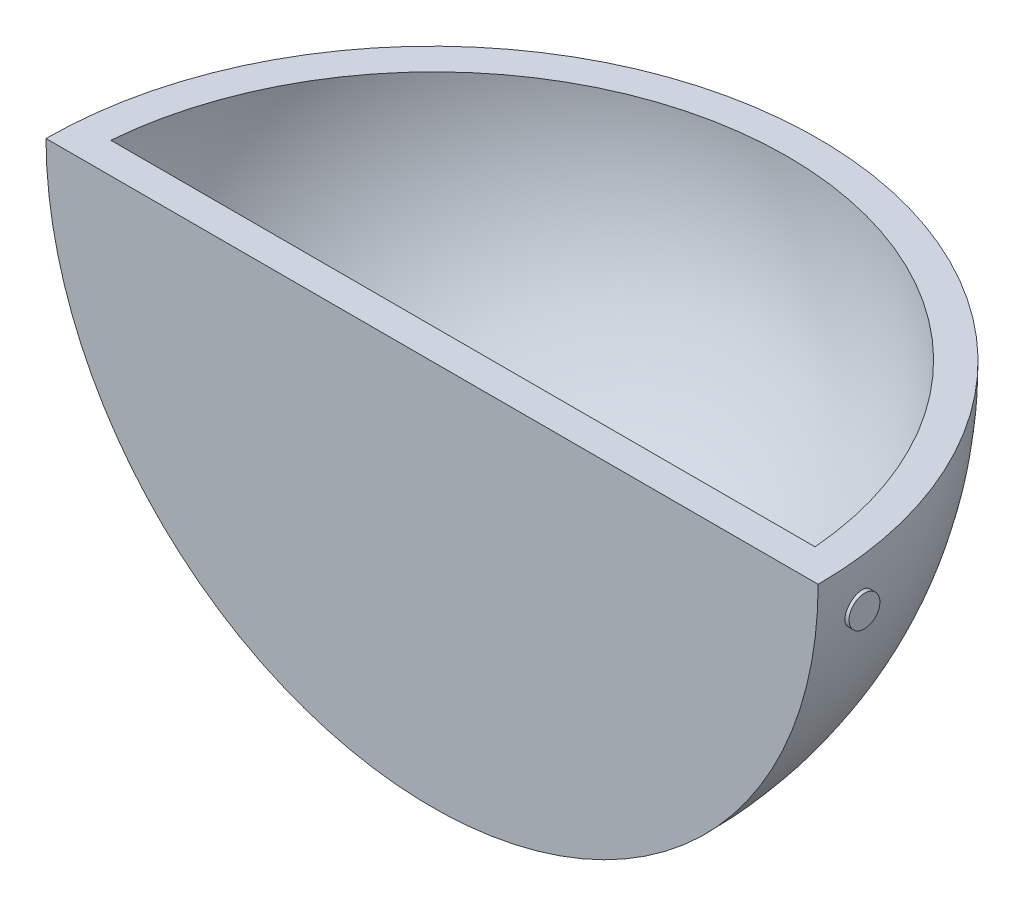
ISO-10303-21;
HEADER;
FILE_DESCRIPTION(('STEP AP214'),'2;1');
FILE_NAME('part.step','',(''),(''),'','','');
FILE_SCHEMA(('AUTOMOTIVE_DESIGN { 1 0 10303 214 1 1 1 1 }'));
ENDSEC;
DATA;
#1=APPLICATION_CONTEXT('core data for automotive mechanical design processes');
#2=APPLICATION_PROTOCOL_DEFINITION('international standard','automotive_design',2000,#1);
#3=PRODUCT_CONTEXT('',#1,'mechanical');
#4=PRODUCT('Part','Part','',(#3));
#5=PRODUCT_RELATED_PRODUCT_CATEGORY('part','',(#4));
#6=PRODUCT_DEFINITION_FORMATION('','',#4);
#7=PRODUCT_DEFINITION_CONTEXT('part definition',#1,'design');
#8=PRODUCT_DEFINITION('design','',#6,#7);
#9=PRODUCT_DEFINITION_SHAPE('','',#8);
#10=(LENGTH_UNIT() NAMED_UNIT(*) SI_UNIT(.MILLI.,.METRE.));
#11=(NAMED_UNIT(*) PLANE_ANGLE_UNIT() SI_UNIT($,.RADIAN.));
#12=(NAMED_UNIT(*) SI_UNIT($,.STERADIAN.) SOLID_ANGLE_UNIT());
#13=UNCERTAINTY_MEASURE_WITH_UNIT(LENGTH_MEASURE(1.E-05),#10,'distance_accuracy_value','');
#14=(GEOMETRIC_REPRESENTATION_CONTEXT(3) GLOBAL_UNCERTAINTY_ASSIGNED_CONTEXT((#13)) GLOBAL_UNIT_ASSIGNED_CONTEXT((#10,
#11,#12)) REPRESENTATION_CONTEXT('',''));
#15=CARTESIAN_POINT('',(0.,0.,0.));
#16=DIRECTION('',(0.,0.,1.));
#17=DIRECTION('',(1.,0.,0.));
#18=AXIS2_PLACEMENT_3D('',#15,#16,#17);
#19=CARTESIAN_POINT('',(125.,0.,0.));
#20=DIRECTION('',(-1.,0.,0.));
#21=DIRECTION('',(0.,0.,1.));
#22=AXIS2_PLACEMENT_3D('',#19,#20,#21);
#23=SPHERICAL_SURFACE('',#22,125.);
#24=CARTESIAN_POINT('',(247.220570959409,-18.5355339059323,-18.5355339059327));
#25=CARTESIAN_POINT('',(247.220570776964,-18.6337839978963,-18.4372852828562));
#26=CARTESIAN_POINT('',(247.221576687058,-18.7279238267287,-18.3349493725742));
#27=CARTESIAN_POINT('',(247.225592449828,-18.9073683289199,-18.1227834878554));
#28=CARTESIAN_POINT('',(247.228602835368,-18.9926706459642,-18.0129515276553));
#29=CARTESIAN_POINT('',(247.236608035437,-19.1538734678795,-17.7865156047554));
#30=CARTESIAN_POINT('',(247.241604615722,-19.2297655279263,-17.6699056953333));
#31=CARTESIAN_POINT('',(247.253544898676,-19.3715603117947,-17.4307995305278));
#32=CARTESIAN_POINT('',(247.260489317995,-19.437459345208,-17.3083011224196));
#33=CARTESIAN_POINT('',(247.276260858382,-19.558714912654,-17.0584881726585));
#34=CARTESIAN_POINT('',(247.285085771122,-19.6140836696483,-16.9311794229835));
#35=CARTESIAN_POINT('',(247.304558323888,-19.7140282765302,-16.6724753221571));
#36=CARTESIAN_POINT('',(247.315206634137,-19.7586001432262,-16.5410784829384));
#37=CARTESIAN_POINT('',(247.338235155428,-19.8366197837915,-16.2752585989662));
#38=CARTESIAN_POINT('',(247.350614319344,-19.8700742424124,-16.1408374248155));
#39=CARTESIAN_POINT('',(247.377020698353,-19.9257094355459,-15.8697898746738));
#40=CARTESIAN_POINT('',(247.391048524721,-19.9478859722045,-15.7331626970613));
#41=CARTESIAN_POINT('',(247.420736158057,-19.9809350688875,-15.4578509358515));
#42=CARTESIAN_POINT('',(247.436405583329,-19.9917363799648,-15.3191588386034));
#43=CARTESIAN_POINT('',(247.469192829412,-20.0017585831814,-15.0414772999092));
#44=CARTESIAN_POINT('',(247.486311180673,-20.000975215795,-14.9024877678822));
#45=CARTESIAN_POINT('',(247.521860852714,-19.9878676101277,-14.6252633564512));
#46=CARTESIAN_POINT('',(247.540291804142,-19.9755466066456,-14.4870282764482));
#47=CARTESIAN_POINT('',(247.578344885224,-19.9394881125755,-14.2121694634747));
#48=CARTESIAN_POINT('',(247.597967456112,-19.915746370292,-14.0755463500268));
#49=CARTESIAN_POINT('',(247.638531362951,-19.8566468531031,-13.8030545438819));
#50=CARTESIAN_POINT('',(247.659486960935,-19.8211361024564,-13.6672211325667));
#51=CARTESIAN_POINT('',(247.702328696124,-19.7388616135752,-13.3991047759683));
#52=CARTESIAN_POINT('',(247.724215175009,-19.6920937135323,-13.2668231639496));
#53=CARTESIAN_POINT('',(247.768751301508,-19.5876748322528,-13.0067984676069));
#54=CARTESIAN_POINT('',(247.791400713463,-19.5300271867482,-12.8790540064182));
#55=CARTESIAN_POINT('',(247.837310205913,-19.4042719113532,-12.6289197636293));
#56=CARTESIAN_POINT('',(247.860570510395,-19.3361603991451,-12.5065319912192));
#57=CARTESIAN_POINT('',(247.931623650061,-19.1149506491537,-12.145654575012));
#58=CARTESIAN_POINT('',(247.980147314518,-18.9462467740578,-11.916611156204));
#59=CARTESIAN_POINT('',(248.077642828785,-18.572677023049,-11.4905302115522));
#60=CARTESIAN_POINT('',(248.126614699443,-18.3678094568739,-11.2934941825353));
#61=CARTESIAN_POINT('',(248.223988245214,-17.9260923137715,-10.9356111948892));
#62=CARTESIAN_POINT('',(248.272384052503,-17.6890412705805,-10.7750107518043));
#63=CARTESIAN_POINT('',(248.36688920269,-17.1906921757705,-10.4964039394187));
#64=CARTESIAN_POINT('',(248.412998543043,-16.9293940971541,-10.3783976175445));
#65=CARTESIAN_POINT('',(248.50148185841,-16.3906922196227,-10.1888388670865));
#66=CARTESIAN_POINT('',(248.543865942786,-16.1133356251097,-10.1171571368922));
#67=CARTESIAN_POINT('',(248.623804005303,-15.5497792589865,-10.0221101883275));
#68=CARTESIAN_POINT('',(248.661358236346,-15.2635799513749,-9.998742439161));
#69=CARTESIAN_POINT('',(248.730134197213,-14.6938209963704,-10.0013478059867));
#70=CARTESIAN_POINT('',(248.761420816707,-14.4102667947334,-10.0267829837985));
#71=CARTESIAN_POINT('',(248.817229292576,-13.8509356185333,-10.1255481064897));
#72=CARTESIAN_POINT('',(248.84175169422,-13.5751580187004,-10.1988741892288));
#73=CARTESIAN_POINT('',(248.882981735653,-13.0433896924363,-10.3901855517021));
#74=CARTESIAN_POINT('',(248.899795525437,-12.7871733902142,-10.5075210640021));
#75=CARTESIAN_POINT('',(248.92560246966,-12.2977750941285,-10.783732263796));
#76=CARTESIAN_POINT('',(248.934596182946,-12.0645914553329,-10.9426049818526));
#77=CARTESIAN_POINT('',(248.944430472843,-11.6305622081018,-11.2953770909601));
#78=CARTESIAN_POINT('',(248.945360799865,-11.4293851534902,-11.4888663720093));
#79=CARTESIAN_POINT('',(248.939275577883,-11.0620285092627,-11.9065040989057));
#80=CARTESIAN_POINT('',(248.932260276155,-10.8958478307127,-12.1306515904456));
#81=CARTESIAN_POINT('',(248.910532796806,-10.6036215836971,-12.6023776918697));
#82=CARTESIAN_POINT('',(248.895845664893,-10.4774475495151,-12.8498779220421));
#83=CARTESIAN_POINT('',(248.85922780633,-10.2678742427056,-13.3618597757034));
#84=CARTESIAN_POINT('',(248.837296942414,-10.1844757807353,-13.6263417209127));
#85=CARTESIAN_POINT('',(248.786683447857,-10.0621584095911,-14.1664296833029));
#86=CARTESIAN_POINT('',(248.757961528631,-10.0235063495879,-14.4420923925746));
#87=CARTESIAN_POINT('',(248.694667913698,-9.99233026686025,-14.995340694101));
#88=CARTESIAN_POINT('',(248.660095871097,-9.99980898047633,-15.2729263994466));
#89=CARTESIAN_POINT('',(248.585612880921,-10.0607392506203,-15.8258504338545));
#90=CARTESIAN_POINT('',(248.545640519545,-10.1147651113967,-16.1011171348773));
#91=CARTESIAN_POINT('',(248.461821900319,-10.2677581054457,-16.6382514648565));
#92=CARTESIAN_POINT('',(248.417975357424,-10.3667285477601,-16.9001181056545));
#93=CARTESIAN_POINT('',(248.327000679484,-10.6082864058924,-17.4068136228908));
#94=CARTESIAN_POINT('',(248.279835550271,-10.7514580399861,-17.6513568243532));
#95=CARTESIAN_POINT('',(248.18405890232,-11.076929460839,-18.1127345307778));
#96=CARTESIAN_POINT('',(248.135447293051,-11.2592317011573,-18.3295672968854));
#97=CARTESIAN_POINT('',(248.062298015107,-11.5588129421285,-18.6302342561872));
#98=CARTESIAN_POINT('',(248.037750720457,-11.6636294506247,-18.7267871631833));
#99=CARTESIAN_POINT('',(247.988814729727,-11.8811260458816,-18.9106088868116));
#100=CARTESIAN_POINT('',(247.964425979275,-11.9938032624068,-18.9978810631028));
#101=CARTESIAN_POINT('',(247.915970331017,-12.2262811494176,-19.1625463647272));
#102=CARTESIAN_POINT('',(247.891903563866,-12.3460846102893,-19.2399355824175));
#103=CARTESIAN_POINT('',(247.844280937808,-12.5918939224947,-19.384212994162));
#104=CARTESIAN_POINT('',(247.820724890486,-12.7178974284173,-19.4511051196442));
#105=CARTESIAN_POINT('',(247.774262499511,-12.9753854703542,-19.5739814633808));
#106=CARTESIAN_POINT('',(247.751356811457,-13.1068752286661,-19.6299549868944));
#107=CARTESIAN_POINT('',(247.706395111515,-13.3742393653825,-19.7304641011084));
#108=CARTESIAN_POINT('',(247.684338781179,-13.5101120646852,-19.77500401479));
#109=CARTESIAN_POINT('',(247.641223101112,-13.7853654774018,-19.8523298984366));
#110=CARTESIAN_POINT('',(247.620164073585,-13.9247473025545,-19.8851120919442));
#111=CARTESIAN_POINT('',(247.579216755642,-14.2059204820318,-19.9386141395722));
#112=CARTESIAN_POINT('',(247.559328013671,-14.3477108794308,-19.9593386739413));
#113=CARTESIAN_POINT('',(247.521024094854,-14.6315388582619,-19.9884284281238));
#114=CARTESIAN_POINT('',(247.502598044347,-14.7735645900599,-19.9968949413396));
#115=CARTESIAN_POINT('',(247.467184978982,-15.0579450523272,-20.0016855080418));
#116=CARTESIAN_POINT('',(247.450197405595,-15.200299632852,-19.9980142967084));
#117=CARTESIAN_POINT('',(247.417775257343,-15.4844372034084,-19.9785149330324));
#118=CARTESIAN_POINT('',(247.402341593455,-15.6262198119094,-19.9626796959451));
#119=CARTESIAN_POINT('',(247.373165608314,-15.9080281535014,-19.9189235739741));
#120=CARTESIAN_POINT('',(247.359422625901,-16.0480545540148,-19.8910074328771));
#121=CARTESIAN_POINT('',(247.333900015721,-16.3235340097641,-19.823701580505));
#122=CARTESIAN_POINT('',(247.322096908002,-16.4590230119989,-19.7844678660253));
#123=CARTESIAN_POINT('',(247.300334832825,-16.7262825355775,-19.6946580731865));
#124=CARTESIAN_POINT('',(247.290375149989,-16.858054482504,-19.6440864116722));
#125=CARTESIAN_POINT('',(247.272382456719,-17.1168363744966,-19.5319826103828));
#126=CARTESIAN_POINT('',(247.264347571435,-17.2438508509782,-19.4704612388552));
#127=CARTESIAN_POINT('',(247.250258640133,-17.4922687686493,-19.3368749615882));
#128=CARTESIAN_POINT('',(247.244204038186,-17.6136737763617,-19.2648130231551));
#129=CARTESIAN_POINT('',(247.232991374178,-17.8765177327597,-19.0933442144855));
#130=CARTESIAN_POINT('',(247.228338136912,-18.0163507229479,-18.9914281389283));
#131=CARTESIAN_POINT('',(247.222128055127,-18.2847535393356,-18.7736272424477));
#132=CARTESIAN_POINT('',(247.220571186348,-18.4133234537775,-18.6577425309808));
#133=CARTESIAN_POINT('',(247.220570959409,-18.5355339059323,-18.5355339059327));
#134=B_SPLINE_CURVE_WITH_KNOTS('',3,(#24,#25,#26,#27,#28,#29,#30,#31,#32,#33,#34,#35,#36,#37,
#38,#39,#40,#41,#42,#43,#44,#45,#46,#47,#48,#49,#50,#51,#52,#53,#54,#55,#56,#57,#58,#59,#60,#61,
#62,#63,#64,#65,#66,#67,#68,#69,#70,#71,#72,#73,#74,#75,#76,#77,#78,#79,#80,#81,#82,#83,#84,#85,
#86,#87,#88,#89,#90,#91,#92,#93,#94,#95,#96,#97,#98,#99,#100,#101,#102,#103,#104,#105,#106,#107,
#108,#109,#110,#111,#112,#113,#114,#115,#116,#117,#118,#119,#120,#121,#122,#123,#124,#125,#126,
#127,#128,#129,#130,#131,#132,#133),.UNSPECIFIED.,.T.,.F.,(4,2,2,2,2,2,2,2,2,2,2,2,2,2,2,2,2,2,
2,2,2,2,2,2,2,2,2,2,2,2,2,2,2,2,2,2,2,2,2,2,2,2,2,2,2,2,2,2,2,2,2,2,2,2,4),(0.,
0.416684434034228,0.833479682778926,1.25064629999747,1.66796660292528,2.08479950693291,
2.50178595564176,2.91852122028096,3.33541148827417,3.75489770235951,4.17453815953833,
4.59406099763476,5.01374013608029,5.43910353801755,5.864624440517,6.29001508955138,
6.71556395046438,7.57688009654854,8.43823651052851,9.30525755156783,10.1722795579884,
11.0368709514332,11.9014170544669,12.7564882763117,13.6114905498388,14.4543367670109,
15.2971227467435,16.1305157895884,16.9638828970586,17.7945462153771,18.6252252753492,
19.4608330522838,20.2964903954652,21.1426082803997,21.9887884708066,22.846669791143,
23.7046049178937,24.1380079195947,24.5712534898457,25.0046698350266,25.4379234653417,
25.8715993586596,26.3051110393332,26.7387618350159,27.1722441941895,27.6021236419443,
28.03183540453,28.4617976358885,28.8915911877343,29.3157226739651,29.7396892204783,
30.1632411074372,30.5866739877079,31.10497978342,31.6232815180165),.UNSPECIFIED.);
#135=CARTESIAN_POINT('',(247.220570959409,-18.5355339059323,-18.5355339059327));
#136=VERTEX_POINT('',#135);
#137=EDGE_CURVE('E95',#136,#136,#134,.T.);
#138=ORIENTED_EDGE('',*,*,#137,.T.);
#139=EDGE_LOOP('',(#138));
#140=FACE_BOUND('',#139,.T.);
#141=CARTESIAN_POINT('',(125.,0.,0.));
#142=DIRECTION('',(0.,0.,1.));
#143=DIRECTION('',(1.,0.,0.));
#144=AXIS2_PLACEMENT_3D('',#141,#142,#143);
#145=CIRCLE('',#144,125.);
#146=CARTESIAN_POINT('',(0.,0.,0.));
#147=VERTEX_POINT('',#146);
#148=CARTESIAN_POINT('',(250.,0.,0.));
#149=VERTEX_POINT('',#148);
#150=EDGE_CURVE('E67',#147,#149,#145,.T.);
#151=ORIENTED_EDGE('',*,*,#150,.F.);
#152=CARTESIAN_POINT('',(125.,0.,0.));
#153=DIRECTION('',(0.,-1.,0.));
#154=DIRECTION('',(1.,0.,0.));
#155=AXIS2_PLACEMENT_3D('',#152,#153,#154);
#156=CIRCLE('',#155,125.);
#157=EDGE_CURVE('E53',#147,#149,#156,.T.);
#158=ORIENTED_EDGE('',*,*,#157,.T.);
#159=EDGE_LOOP('',(#151,#158));
#160=FACE_BOUND('',#159,.T.);
#161=CARTESIAN_POINT('',(2.77942904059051,-18.5355339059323,-18.5355339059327));
#162=CARTESIAN_POINT('',(2.77942922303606,-18.4372852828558,-18.6337839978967));
#163=CARTESIAN_POINT('',(2.77842331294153,-18.3349493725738,-18.7279238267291));
#164=CARTESIAN_POINT('',(2.7744075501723,-18.1227834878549,-18.9073683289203));
#165=CARTESIAN_POINT('',(2.77139716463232,-18.0129515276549,-18.9926706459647));
#166=CARTESIAN_POINT('',(2.76339196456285,-17.786515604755,-19.15387346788));
#167=CARTESIAN_POINT('',(2.75839538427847,-17.6699056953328,-19.2297655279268));
#168=CARTESIAN_POINT('',(2.74645510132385,-17.4307995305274,-19.3715603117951));
#169=CARTESIAN_POINT('',(2.73951068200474,-17.3083011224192,-19.4374593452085));
#170=CARTESIAN_POINT('',(2.72373914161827,-17.0584881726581,-19.5587149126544));
#171=CARTESIAN_POINT('',(2.71491422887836,-16.9311794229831,-19.6140836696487));
#172=CARTESIAN_POINT('',(2.69544167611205,-16.6724753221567,-19.7140282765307));
#173=CARTESIAN_POINT('',(2.68479336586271,-16.541078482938,-19.7586001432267));
#174=CARTESIAN_POINT('',(2.66176484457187,-16.2752585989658,-19.836619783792));
#175=CARTESIAN_POINT('',(2.6493856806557,-16.1408374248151,-19.8700742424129));
#176=CARTESIAN_POINT('',(2.62297930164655,-15.8697898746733,-19.9257094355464));
#177=CARTESIAN_POINT('',(2.60895147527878,-15.7331626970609,-19.947885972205));
#178=CARTESIAN_POINT('',(2.57926384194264,-15.457850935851,-19.9809350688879));
#179=CARTESIAN_POINT('',(2.56359441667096,-15.319158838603,-19.9917363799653));
#180=CARTESIAN_POINT('',(2.53080717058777,-15.0414772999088,-20.0017585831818));
#181=CARTESIAN_POINT('',(2.51368881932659,-14.9024877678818,-20.0009752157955));
#182=CARTESIAN_POINT('',(2.47813914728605,-14.6252633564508,-19.9878676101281));
#183=CARTESIAN_POINT('',(2.45970819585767,-14.4870282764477,-19.975546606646));
#184=CARTESIAN_POINT('',(2.42165511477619,-14.2121694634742,-19.939488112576));
#185=CARTESIAN_POINT('',(2.40203254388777,-14.0755463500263,-19.9157463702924));
#186=CARTESIAN_POINT('',(2.36146863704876,-13.8030545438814,-19.8566468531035));
#187=CARTESIAN_POINT('',(2.34051303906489,-13.6672211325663,-19.8211361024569));
#188=CARTESIAN_POINT('',(2.29767130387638,-13.3991047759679,-19.7388616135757));
#189=CARTESIAN_POINT('',(2.2757848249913,-13.2668231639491,-19.6920937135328));
#190=CARTESIAN_POINT('',(2.23124869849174,-13.0067984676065,-19.5876748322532));
#191=CARTESIAN_POINT('',(2.20859928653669,-12.8790540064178,-19.5300271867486));
#192=CARTESIAN_POINT('',(2.16268979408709,-12.6289197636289,-19.4042719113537));
#193=CARTESIAN_POINT('',(2.13942948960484,-12.5065319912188,-19.3361603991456));
#194=CARTESIAN_POINT('',(2.06837634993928,-12.1456545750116,-19.1149506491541));
#195=CARTESIAN_POINT('',(2.01985268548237,-11.9166111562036,-18.9462467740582));
#196=CARTESIAN_POINT('',(1.92235717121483,-11.4905302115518,-18.5726770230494));
#197=CARTESIAN_POINT('',(1.87338530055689,-11.2934941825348,-18.3678094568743));
#198=CARTESIAN_POINT('',(1.77601175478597,-10.9356111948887,-17.9260923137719));
#199=CARTESIAN_POINT('',(1.72761594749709,-10.7750107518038,-17.6890412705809));
#200=CARTESIAN_POINT('',(1.63311079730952,-10.4964039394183,-17.190692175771));
#201=CARTESIAN_POINT('',(1.58700145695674,-10.378397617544,-16.9293940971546));
#202=CARTESIAN_POINT('',(1.49851814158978,-10.1888388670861,-16.3906922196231));
#203=CARTESIAN_POINT('',(1.45613405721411,-10.1171571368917,-16.1133356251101));
#204=CARTESIAN_POINT('',(1.37619599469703,-10.0221101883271,-15.5497792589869));
#205=CARTESIAN_POINT('',(1.33864176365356,-9.99874243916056,-15.2635799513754));
#206=CARTESIAN_POINT('',(1.26986580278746,-10.0013478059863,-14.6938209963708));
#207=CARTESIAN_POINT('',(1.23857918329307,-10.026782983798,-14.4102667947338));
#208=CARTESIAN_POINT('',(1.18277070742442,-10.1255481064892,-13.8509356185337));
#209=CARTESIAN_POINT('',(1.15824830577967,-10.1988741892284,-13.5751580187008));
#210=CARTESIAN_POINT('',(1.11701826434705,-10.3901855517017,-13.0433896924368));
#211=CARTESIAN_POINT('',(1.10020447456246,-10.5075210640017,-12.7871733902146));
#212=CARTESIAN_POINT('',(1.07439753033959,-10.7837322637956,-12.2977750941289));
#213=CARTESIAN_POINT('',(1.06540381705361,-10.9426049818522,-12.0645914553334));
#214=CARTESIAN_POINT('',(1.05556952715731,-11.2953770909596,-11.6305622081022));
#215=CARTESIAN_POINT('',(1.05463920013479,-11.4888663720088,-11.4293851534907));
#216=CARTESIAN_POINT('',(1.06072442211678,-11.9065040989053,-11.0620285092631));
#217=CARTESIAN_POINT('',(1.06773972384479,-12.1306515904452,-10.8958478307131));
#218=CARTESIAN_POINT('',(1.08946720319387,-12.6023776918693,-10.6036215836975));
#219=CARTESIAN_POINT('',(1.10415433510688,-12.8498779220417,-10.4774475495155));
#220=CARTESIAN_POINT('',(1.14077219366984,-13.361859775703,-10.267874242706));
#221=CARTESIAN_POINT('',(1.16270305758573,-13.6263417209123,-10.1844757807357));
#222=CARTESIAN_POINT('',(1.21331655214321,-14.1664296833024,-10.0621584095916));
#223=CARTESIAN_POINT('',(1.24203847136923,-14.4420923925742,-10.0235063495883));
#224=CARTESIAN_POINT('',(1.30533208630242,-14.9953406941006,-9.99233026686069));
#225=CARTESIAN_POINT('',(1.33990412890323,-15.2729263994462,-9.99980898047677));
#226=CARTESIAN_POINT('',(1.41438711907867,-15.8258504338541,-10.0607392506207));
#227=CARTESIAN_POINT('',(1.45435948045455,-16.1011171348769,-10.1147651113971));
#228=CARTESIAN_POINT('',(1.53817809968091,-16.6382514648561,-10.2677581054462));
#229=CARTESIAN_POINT('',(1.58202464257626,-16.9001181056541,-10.3667285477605));
#230=CARTESIAN_POINT('',(1.67299932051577,-17.4068136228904,-10.6082864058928));
#231=CARTESIAN_POINT('',(1.72016444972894,-17.6513568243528,-10.7514580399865));
#232=CARTESIAN_POINT('',(1.81594109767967,-18.1127345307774,-11.0769294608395));
#233=CARTESIAN_POINT('',(1.86455270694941,-18.3295672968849,-11.2592317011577));
#234=CARTESIAN_POINT('',(1.93770198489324,-18.6302342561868,-11.5588129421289));
#235=CARTESIAN_POINT('',(1.96224927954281,-18.7267871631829,-11.6636294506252));
#236=CARTESIAN_POINT('',(2.01118527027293,-18.9106088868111,-11.881126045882));
#237=CARTESIAN_POINT('',(2.03557402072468,-18.9978810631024,-11.9938032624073));
#238=CARTESIAN_POINT('',(2.0840296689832,-19.1625463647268,-12.226281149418));
#239=CARTESIAN_POINT('',(2.10809643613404,-19.2399355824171,-12.3460846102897));
#240=CARTESIAN_POINT('',(2.15571906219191,-19.3842129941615,-12.5918939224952));
#241=CARTESIAN_POINT('',(2.17927510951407,-19.4511051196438,-12.7178974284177));
#242=CARTESIAN_POINT('',(2.22573750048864,-19.5739814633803,-12.9753854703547));
#243=CARTESIAN_POINT('',(2.24864318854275,-19.629954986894,-13.1068752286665));
#244=CARTESIAN_POINT('',(2.29360488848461,-19.7304641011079,-13.374239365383));
#245=CARTESIAN_POINT('',(2.31566121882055,-19.7750040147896,-13.5101120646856));
#246=CARTESIAN_POINT('',(2.35877689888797,-19.8523298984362,-13.7853654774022));
#247=CARTESIAN_POINT('',(2.3798359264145,-19.8851120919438,-13.924747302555));
#248=CARTESIAN_POINT('',(2.42078324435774,-19.9386141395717,-14.2059204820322));
#249=CARTESIAN_POINT('',(2.4406719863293,-19.9593386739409,-14.3477108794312));
#250=CARTESIAN_POINT('',(2.47897590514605,-19.9884284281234,-14.6315388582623));
#251=CARTESIAN_POINT('',(2.49740195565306,-19.9968949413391,-14.7735645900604));
#252=CARTESIAN_POINT('',(2.53281502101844,-20.0016855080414,-15.0579450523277));
#253=CARTESIAN_POINT('',(2.54980259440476,-19.998014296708,-15.2002996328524));
#254=CARTESIAN_POINT('',(2.58222474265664,-19.9785149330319,-15.4844372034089));
#255=CARTESIAN_POINT('',(2.59765840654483,-19.9626796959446,-15.6262198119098));
#256=CARTESIAN_POINT('',(2.62683439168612,-19.9189235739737,-15.9080281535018));
#257=CARTESIAN_POINT('',(2.64057737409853,-19.8910074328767,-16.0480545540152));
#258=CARTESIAN_POINT('',(2.66609998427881,-19.8237015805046,-16.3235340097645));
#259=CARTESIAN_POINT('',(2.67790309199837,-19.7844678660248,-16.4590230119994));
#260=CARTESIAN_POINT('',(2.69966516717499,-19.6946580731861,-16.726282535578));
#261=CARTESIAN_POINT('',(2.70962485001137,-19.6440864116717,-16.8580544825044));
#262=CARTESIAN_POINT('',(2.72761754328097,-19.5319826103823,-17.116836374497));
#263=CARTESIAN_POINT('',(2.73565242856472,-19.4704612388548,-17.2438508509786));
#264=CARTESIAN_POINT('',(2.74974135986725,-19.3368749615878,-17.4922687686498));
#265=CARTESIAN_POINT('',(2.75579596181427,-19.2648130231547,-17.6136737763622));
#266=CARTESIAN_POINT('',(2.76700862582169,-19.093344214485,-17.8765177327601));
#267=CARTESIAN_POINT('',(2.77166186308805,-18.9914281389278,-18.0163507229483));
#268=CARTESIAN_POINT('',(2.77787194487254,-18.7736272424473,-18.284753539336));
#269=CARTESIAN_POINT('',(2.77942881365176,-18.6577425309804,-18.4133234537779));
#270=CARTESIAN_POINT('',(2.77942904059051,-18.5355339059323,-18.5355339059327));
#271=B_SPLINE_CURVE_WITH_KNOTS('',3,(#161,#162,#163,#164,#165,#166,#167,#168,#169,#170,#171,
#172,#173,#174,#175,#176,#177,#178,#179,#180,#181,#182,#183,#184,#185,#186,#187,#188,#189,#190,
#191,#192,#193,#194,#195,#196,#197,#198,#199,#200,#201,#202,#203,#204,#205,#206,#207,#208,#209,
#210,#211,#212,#213,#214,#215,#216,#217,#218,#219,#220,#221,#222,#223,#224,#225,#226,#227,#228,
#229,#230,#231,#232,#233,#234,#235,#236,#237,#238,#239,#240,#241,#242,#243,#244,#245,#246,#247,
#248,#249,#250,#251,#252,#253,#254,#255,#256,#257,#258,#259,#260,#261,#262,#263,#264,#265,#266,
#267,#268,#269,#270),.UNSPECIFIED.,.T.,.F.,(4,2,2,2,2,2,2,2,2,2,2,2,2,2,2,2,2,2,2,2,2,2,2,2,2,2,
2,2,2,2,2,2,2,2,2,2,2,2,2,2,2,2,2,2,2,2,2,2,2,2,2,2,2,2,4),(0.,0.416684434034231,
0.833479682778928,1.25064629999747,1.66796660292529,2.08479950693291,2.50178595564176,
2.91852122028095,3.33541148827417,3.75489770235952,4.17453815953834,4.59406099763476,
5.01374013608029,5.43910353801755,5.864624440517,6.29001508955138,6.71556395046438,
7.57688009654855,8.43823651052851,9.30525755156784,10.1722795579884,11.0368709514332,
11.9014170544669,12.7564882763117,13.6114905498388,14.4543367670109,15.2971227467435,
16.1305157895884,16.9638828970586,17.7945462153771,18.6252252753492,19.4608330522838,
20.2964903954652,21.1426082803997,21.9887884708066,22.846669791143,23.7046049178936,
24.1380079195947,24.5712534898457,25.0046698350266,25.4379234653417,25.8715993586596,
26.3051110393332,26.7387618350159,27.1722441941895,27.6021236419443,28.03183540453,
28.4617976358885,28.8915911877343,29.3157226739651,29.7396892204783,30.1632411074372,
30.5866739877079,31.10497978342,31.6232815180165),.UNSPECIFIED.);
#272=CARTESIAN_POINT('',(2.77942904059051,-18.5355339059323,-18.5355339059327));
#273=VERTEX_POINT('',#272);
#274=EDGE_CURVE('E43',#273,#273,#271,.T.);
#275=ORIENTED_EDGE('',*,*,#274,.T.);
#276=EDGE_LOOP('',(#275));
#277=FACE_BOUND('',#276,.T.);
#278=ADVANCED_FACE('F39',(#140,#160,#277),#23,.T.);
#279=CARTESIAN_POINT('',(125.,0.,0.));
#280=DIRECTION('',(0.,-1.,0.));
#281=DIRECTION('',(1.,0.,0.));
#282=AXIS2_PLACEMENT_3D('',#279,#280,#281);
#283=PLANE('',#282);
#284=DIRECTION('',(1.,0.,0.));
#285=VECTOR('',#284,1.);
#286=CARTESIAN_POINT('',(11.,0.,-10.));
#287=LINE('',#286,#285);
#288=CARTESIAN_POINT('',(11.,0.,-10.));
#289=VERTEX_POINT('',#288);
#290=CARTESIAN_POINT('',(239.,0.,-10.));
#291=VERTEX_POINT('',#290);
#292=EDGE_CURVE('E79',#289,#291,#287,.T.);
#293=ORIENTED_EDGE('',*,*,#292,.F.);
#294=CARTESIAN_POINT('',(125.,0.,-0.614285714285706));
#295=DIRECTION('',(0.,1.,0.));
#296=DIRECTION('',(0.,0.,1.));
#297=AXIS2_PLACEMENT_3D('',#294,#295,#296);
#298=CIRCLE('',#297,114.385714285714);
#299=EDGE_CURVE('E76',#291,#289,#298,.T.);
#300=ORIENTED_EDGE('',*,*,#299,.F.);
#301=EDGE_LOOP('',(#293,#300));
#302=FACE_BOUND('',#301,.T.);
#303=ORIENTED_EDGE('',*,*,#157,.F.);
#304=DIRECTION('',(-1.,0.,0.));
#305=VECTOR('',#304,1.);
#306=CARTESIAN_POINT('',(0.,0.,0.));
#307=LINE('',#306,#305);
#308=EDGE_CURVE('E11',#149,#147,#307,.T.);
#309=ORIENTED_EDGE('',*,*,#308,.F.);
#310=EDGE_LOOP('',(#303,#309));
#311=FACE_BOUND('',#310,.T.);
#312=ADVANCED_FACE('F86',(#302,#311),#283,.F.);
#313=CARTESIAN_POINT('',(125.,0.,0.));
#314=DIRECTION('',(0.,0.,1.));
#315=DIRECTION('',(1.,0.,0.));
#316=AXIS2_PLACEMENT_3D('',#313,#314,#315);
#317=PLANE('',#316);
#318=ORIENTED_EDGE('',*,*,#150,.T.);
#319=ORIENTED_EDGE('',*,*,#308,.T.);
#320=EDGE_LOOP('',(#318,#319));
#321=FACE_BOUND('',#320,.T.);
#322=ADVANCED_FACE('F117',(#321),#317,.T.);
#323=CARTESIAN_POINT('',(250.,-14.9999999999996,-15.));
#324=DIRECTION('',(1.,0.,0.));
#325=DIRECTION('',(0.,0.,-1.));
#326=AXIS2_PLACEMENT_3D('',#323,#324,#325);
#327=PLANE('',#326);
#328=CARTESIAN_POINT('',(250.,-14.9999999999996,-15.));
#329=DIRECTION('',(1.,0.,0.));
#330=DIRECTION('',(0.,0.,-1.));
#331=AXIS2_PLACEMENT_3D('',#328,#329,#330);
#332=CIRCLE('',#331,5.);
#333=CARTESIAN_POINT('',(250.,-14.9999999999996,-20.));
#334=VERTEX_POINT('',#333);
#335=EDGE_CURVE('E91',#334,#334,#332,.T.);
#336=ORIENTED_EDGE('',*,*,#335,.T.);
#337=EDGE_LOOP('',(#336));
#338=FACE_BOUND('',#337,.T.);
#339=ADVANCED_FACE('F113',(#338),#327,.T.);
#340=CARTESIAN_POINT('',(250.,-14.9999999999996,-15.));
#341=DIRECTION('',(-1.,0.,0.));
#342=DIRECTION('',(0.,0.,1.));
#343=AXIS2_PLACEMENT_3D('',#340,#341,#342);
#344=CYLINDRICAL_SURFACE('',#343,5.);
#345=ORIENTED_EDGE('',*,*,#137,.F.);
#346=EDGE_LOOP('',(#345));
#347=FACE_BOUND('',#346,.T.);
#348=ORIENTED_EDGE('',*,*,#335,.F.);
#349=EDGE_LOOP('',(#348));
#350=FACE_BOUND('',#349,.T.);
#351=ADVANCED_FACE('F107',(#347,#350),#344,.T.);
#352=ORIENTED_EDGE('',*,*,#274,.F.);
#353=EDGE_LOOP('',(#352));
#354=FACE_BOUND('',#353,.T.);
#355=CARTESIAN_POINT('',(0.,-14.9999999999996,-15.));
#356=DIRECTION('',(1.,0.,0.));
#357=DIRECTION('',(0.,0.,-1.));
#358=AXIS2_PLACEMENT_3D('',#355,#356,#357);
#359=CIRCLE('',#358,5.);
#360=CARTESIAN_POINT('',(0.,-14.9999999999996,-20.));
#361=VERTEX_POINT('',#360);
#362=EDGE_CURVE('E84',#361,#361,#359,.T.);
#363=ORIENTED_EDGE('',*,*,#362,.T.);
#364=EDGE_LOOP('',(#363));
#365=FACE_BOUND('',#364,.T.);
#366=ADVANCED_FACE('F112',(#354,#365),#344,.T.);
#367=CARTESIAN_POINT('',(0.,-14.9999999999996,-15.));
#368=DIRECTION('',(1.,0.,0.));
#369=DIRECTION('',(0.,0.,-1.));
#370=AXIS2_PLACEMENT_3D('',#367,#368,#369);
#371=PLANE('',#370);
#372=ORIENTED_EDGE('',*,*,#362,.F.);
#373=EDGE_LOOP('',(#372));
#374=FACE_BOUND('',#373,.T.);
#375=ADVANCED_FACE('F115',(#374),#371,.F.);
#376=CARTESIAN_POINT('',(125.,0.,-0.614285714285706));
#377=DIRECTION('',(0.,-1.,0.));
#378=DIRECTION('',(0.,0.,-1.));
#379=AXIS2_PLACEMENT_3D('',#376,#377,#378);
#380=CIRCLE('',#379,114.385714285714);
#381=TRIMMED_CURVE('',#380,(PARAMETER_VALUE(-1.48865076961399)),
(PARAMETER_VALUE(1.48865076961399)),.T.,.PARAMETER.);
#382=CARTESIAN_POINT('',(125.,0.,-10.));
#383=DIRECTION('',(1.,0.,0.));
#384=AXIS1_PLACEMENT('',#382,#383);
#385=SURFACE_OF_REVOLUTION('',#381,#384);
#386=ORIENTED_EDGE('',*,*,#299,.T.);
#387=CARTESIAN_POINT('',(125.,9.38571428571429,-10.));
#388=DIRECTION('',(0.,0.,-1.));
#389=DIRECTION('',(0.,1.,0.));
#390=AXIS2_PLACEMENT_3D('',#387,#388,#389);
#391=CIRCLE('',#390,114.385714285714);
#392=EDGE_CURVE('E60',#291,#289,#391,.T.);
#393=ORIENTED_EDGE('',*,*,#392,.F.);
#394=EDGE_LOOP('',(#386,#393));
#395=FACE_BOUND('',#394,.T.);
#396=ADVANCED_FACE('F74',(#395),#385,.F.);
#397=CARTESIAN_POINT('',(125.,9.38571428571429,-10.));
#398=DIRECTION('',(0.,0.,-1.));
#399=DIRECTION('',(0.,1.,0.));
#400=AXIS2_PLACEMENT_3D('',#397,#398,#399);
#401=PLANE('',#400);
#402=ORIENTED_EDGE('',*,*,#392,.T.);
#403=ORIENTED_EDGE('',*,*,#292,.T.);
#404=EDGE_LOOP('',(#402,#403));
#405=FACE_BOUND('',#404,.T.);
#406=ADVANCED_FACE('F81',(#405),#401,.T.);
#407=CLOSED_SHELL('',(#278,#312,#322,#339,#351,#366,#375,#396,#406));
#408=MANIFOLD_SOLID_BREP('B2',#407);
#409=ADVANCED_BREP_SHAPE_REPRESENTATION('',(#18,#408),#14);
#410=SHAPE_DEFINITION_REPRESENTATION(#9,#409);
ENDSEC;
END-ISO-10303-21;
